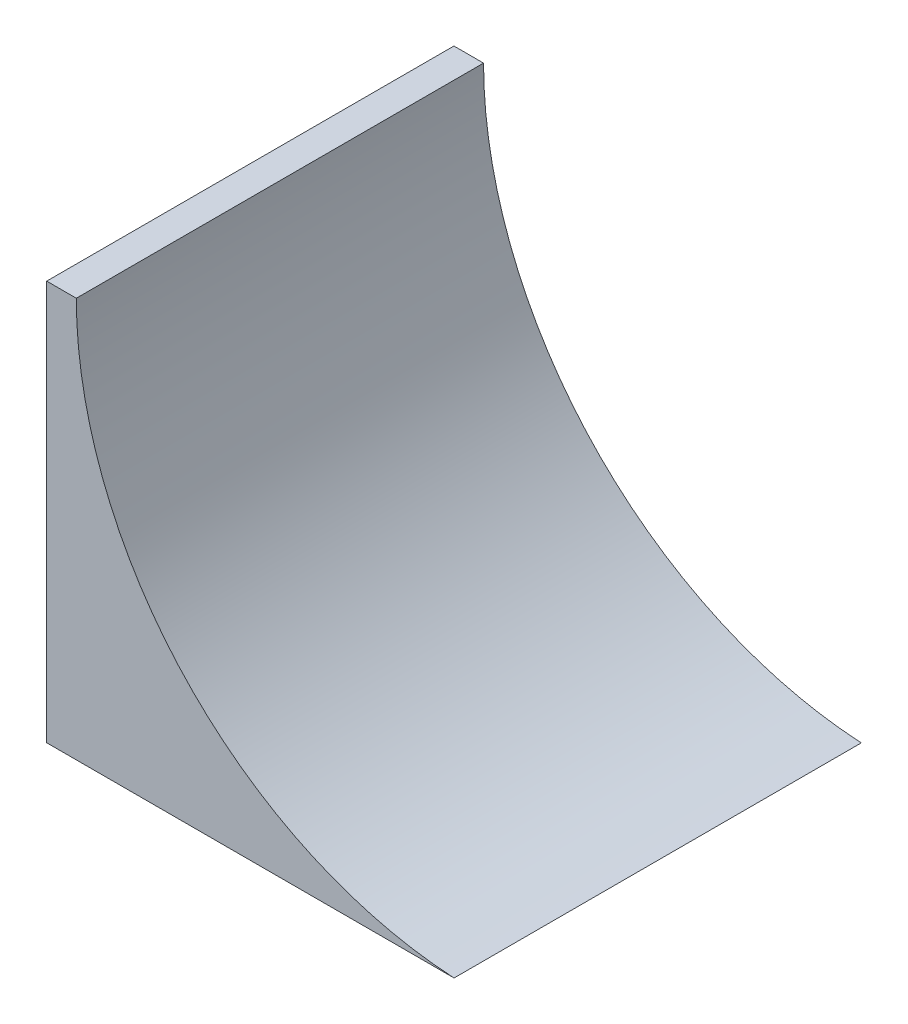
from build123d import *

# Parameters (mm, degrees)
BOSS_EXTRUDE1_DEPTH = 34.925
SKETCH2_R           = 4.064
CUT_EXTRUDE1_DEPTH  = 3.048


with BuildPart() as part:
    # Sketch1 → Boss-Extrude1 (new, symmetric)
    with BuildSketch(Plane.XY):
        with BuildLine():
            Line((0, 0), (0, 68.58))
            Line((0, 68.58), (5.08, 68.58))
            ThreePointArc((5.08, 68.58), (23.840783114, 21.405753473), (69.875229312, 0))
            Line((69.875229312, 0), (0, 0))
        make_face()
    extrude(amount=BOSS_EXTRUDE1_DEPTH, both=True)

    # Sketch2 → Cut-Extrude1 (cut)
    with BuildSketch(Plane.ZY):
        with Locations((-17.4625, 31.75)):
            Circle(SKETCH2_R)
        with Locations((17.4625, 31.75)):
            Circle(SKETCH2_R)
    extrude(amount=-CUT_EXTRUDE1_DEPTH, mode=Mode.SUBTRACT)


solid = part.part
